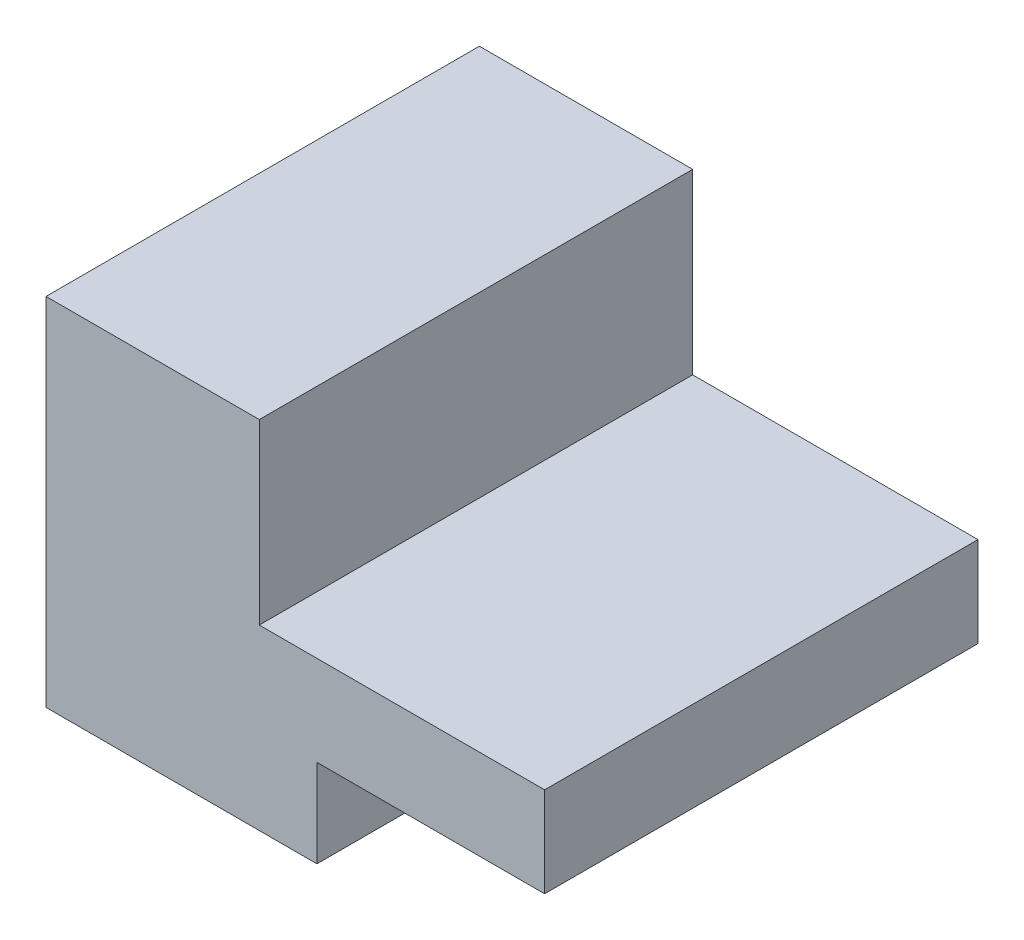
from build123d import *

# Parameters (mm, degrees)
EXTRUSION1_DEPTH = 42


with BuildPart() as part:
    # Esquisse2 → Extrusion1 (new body)
    with BuildSketch(Plane.XY):
        Polygon((-32.959259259, 0), (-32.959259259, 34.49549592), (-12.289893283, 34.49549592), (-12.289893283, 17.24774796), (15.362366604, 17.24774796), (15.362366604, 8.519130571), (-6.703578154, 8.519130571), (-6.703578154, 0), align=None)
    extrude(amount=EXTRUSION1_DEPTH)


solid = part.part
